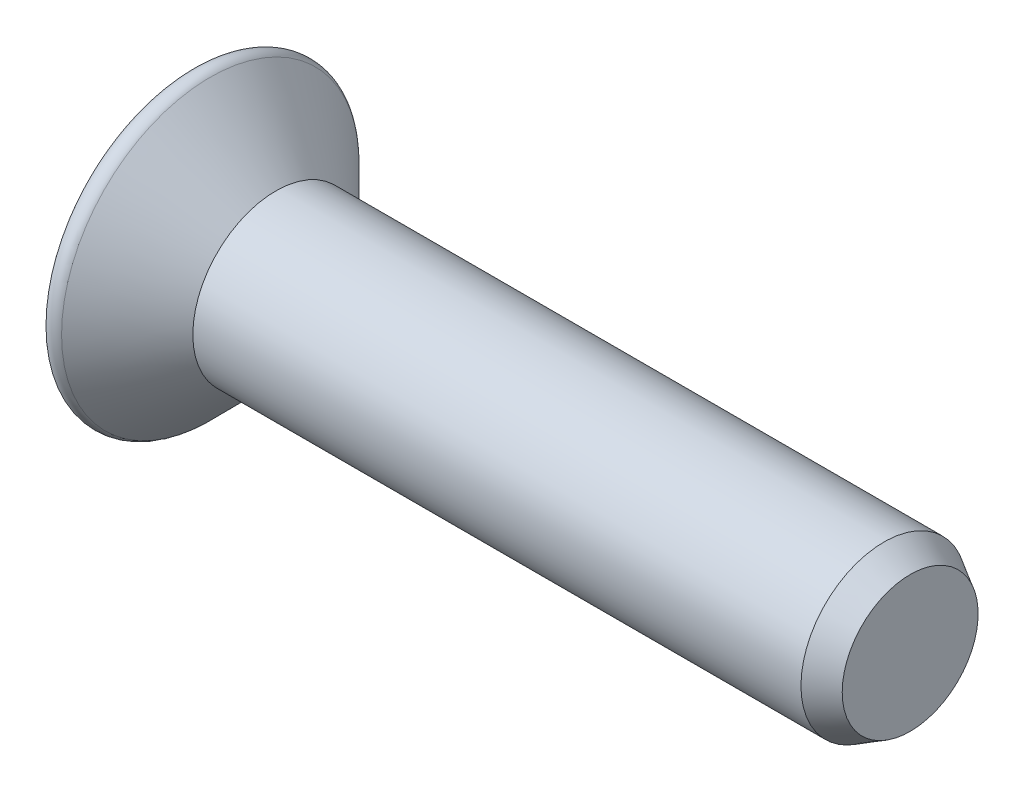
ISO-10303-21;
HEADER;
FILE_DESCRIPTION(('STEP AP214'),'2;1');
FILE_NAME('part.step','',(''),(''),'','','');
FILE_SCHEMA(('AUTOMOTIVE_DESIGN { 1 0 10303 214 1 1 1 1 }'));
ENDSEC;
DATA;
#1=APPLICATION_CONTEXT('core data for automotive mechanical design processes');
#2=APPLICATION_PROTOCOL_DEFINITION('international standard','automotive_design',2000,#1);
#3=PRODUCT_CONTEXT('',#1,'mechanical');
#4=PRODUCT('Part','Part','',(#3));
#5=PRODUCT_RELATED_PRODUCT_CATEGORY('part','',(#4));
#6=PRODUCT_DEFINITION_FORMATION('','',#4);
#7=PRODUCT_DEFINITION_CONTEXT('part definition',#1,'design');
#8=PRODUCT_DEFINITION('design','',#6,#7);
#9=PRODUCT_DEFINITION_SHAPE('','',#8);
#10=(LENGTH_UNIT() NAMED_UNIT(*) SI_UNIT(.MILLI.,.METRE.));
#11=(NAMED_UNIT(*) PLANE_ANGLE_UNIT() SI_UNIT($,.RADIAN.));
#12=(NAMED_UNIT(*) SI_UNIT($,.STERADIAN.) SOLID_ANGLE_UNIT());
#13=UNCERTAINTY_MEASURE_WITH_UNIT(LENGTH_MEASURE(1.E-05),#10,'distance_accuracy_value','');
#14=(GEOMETRIC_REPRESENTATION_CONTEXT(3) GLOBAL_UNCERTAINTY_ASSIGNED_CONTEXT((#13)) GLOBAL_UNIT_ASSIGNED_CONTEXT((#10,
#11,#12)) REPRESENTATION_CONTEXT('',''));
#15=CARTESIAN_POINT('',(0.,0.,0.));
#16=DIRECTION('',(0.,0.,1.));
#17=DIRECTION('',(1.,0.,0.));
#18=AXIS2_PLACEMENT_3D('',#15,#16,#17);
#19=CARTESIAN_POINT('',(2.4,0.,0.));
#20=DIRECTION('',(-1.,0.,0.));
#21=DIRECTION('',(0.,1.,0.));
#22=AXIS2_PLACEMENT_3D('',#19,#20,#21);
#23=SPHERICAL_SURFACE('',#22,4.);
#24=CARTESIAN_POINT('',(-1.1,0.,0.));
#25=DIRECTION('',(-1.,0.,0.));
#26=DIRECTION('',(0.,0.,1.));
#27=AXIS2_PLACEMENT_3D('',#24,#25,#26);
#28=CIRCLE('',#27,1.93649167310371);
#29=CARTESIAN_POINT('',(-1.1,0.,1.93649167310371));
#30=VERTEX_POINT('',#29);
#31=EDGE_CURVE('E193',#30,#30,#28,.T.);
#32=ORIENTED_EDGE('',*,*,#31,.T.);
#33=EDGE_LOOP('',(#32));
#34=FACE_BOUND('',#33,.T.);
#35=CARTESIAN_POINT('',(2.35629520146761,0.0815496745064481,0.407748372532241));
#36=DIRECTION('',(0.104528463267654,-0.195041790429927,-0.975208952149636));
#37=DIRECTION('',(0.,0.98058067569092,-0.196116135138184));
#38=AXIS2_PLACEMENT_3D('',#35,#36,#37);
#39=CIRCLE('',#38,3.97808758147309);
#40=CARTESIAN_POINT('',(-1.44518808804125,1.08372861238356,-0.200152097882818));
#41=VERTEX_POINT('',#40);
#42=CARTESIAN_POINT('',(-1.52998706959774,0.732056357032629,-0.138906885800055));
#43=VERTEX_POINT('',#42);
#44=EDGE_CURVE('E11',#41,#43,#39,.F.);
#45=ORIENTED_EDGE('',*,*,#44,.F.);
#46=CARTESIAN_POINT('',(2.47064663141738,0.672157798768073,0.));
#47=DIRECTION('',(0.104528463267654,0.994521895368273,0.));
#48=DIRECTION('',(-0.994521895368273,0.104528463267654,0.));
#49=AXIS2_PLACEMENT_3D('',#46,#47,#48);
#50=CIRCLE('',#49,3.94248816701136);
#51=CARTESIAN_POINT('',(-1.44518808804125,1.08372861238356,0.200152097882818));
#52=VERTEX_POINT('',#51);
#53=EDGE_CURVE('E49',#52,#41,#50,.F.);
#54=ORIENTED_EDGE('',*,*,#53,.F.);
#55=CARTESIAN_POINT('',(2.35629520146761,0.0815496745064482,-0.407748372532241));
#56=DIRECTION('',(0.104528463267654,-0.195041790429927,0.975208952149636));
#57=DIRECTION('',(0.,-0.98058067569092,-0.196116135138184));
#58=AXIS2_PLACEMENT_3D('',#55,#56,#57);
#59=CIRCLE('',#58,3.97808758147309);
#60=CARTESIAN_POINT('',(-1.52998706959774,0.732056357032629,0.138906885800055));
#61=VERTEX_POINT('',#60);
#62=EDGE_CURVE('E333',#61,#52,#59,.F.);
#63=ORIENTED_EDGE('',*,*,#62,.F.);
#64=CARTESIAN_POINT('',(2.40761651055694,0.0362331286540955,0.0627576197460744));
#65=DIRECTION('',(0.104528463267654,0.49726094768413,0.861281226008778));
#66=DIRECTION('',(0.,-0.866025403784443,0.499999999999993));
#67=AXIS2_PLACEMENT_3D('',#64,#65,#66);
#68=CIRCLE('',#67,3.99933627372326);
#69=CARTESIAN_POINT('',(-1.56766455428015,0.358913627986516,0.358913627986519));
#70=VERTEX_POINT('',#69);
#71=EDGE_CURVE('E331',#70,#61,#68,.F.);
#72=ORIENTED_EDGE('',*,*,#71,.F.);
#73=CARTESIAN_POINT('',(2.40761651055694,0.0627576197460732,0.0362331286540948));
#74=DIRECTION('',(0.104528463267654,0.861281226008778,0.497260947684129));
#75=DIRECTION('',(0.,-0.499999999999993,0.866025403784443));
#76=AXIS2_PLACEMENT_3D('',#73,#74,#75);
#77=CIRCLE('',#76,3.99933627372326);
#78=CARTESIAN_POINT('',(-1.52998706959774,0.138906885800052,0.732056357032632));
#79=VERTEX_POINT('',#78);
#80=EDGE_CURVE('E329',#79,#70,#77,.F.);
#81=ORIENTED_EDGE('',*,*,#80,.F.);
#82=CARTESIAN_POINT('',(2.35629520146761,-0.407748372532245,0.0815496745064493));
#83=DIRECTION('',(0.104528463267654,0.975208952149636,-0.195041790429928));
#84=DIRECTION('',(0.,0.196116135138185,0.98058067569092));
#85=AXIS2_PLACEMENT_3D('',#82,#83,#84);
#86=CIRCLE('',#85,3.97808758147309);
#87=CARTESIAN_POINT('',(-1.44518808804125,0.200152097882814,1.08372861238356));
#88=VERTEX_POINT('',#87);
#89=EDGE_CURVE('E327',#88,#79,#86,.F.);
#90=ORIENTED_EDGE('',*,*,#89,.F.);
#91=CARTESIAN_POINT('',(2.47064663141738,0.,0.672157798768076));
#92=DIRECTION('',(0.104528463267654,0.,0.994521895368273));
#93=DIRECTION('',(0.994521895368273,0.,-0.104528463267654));
#94=AXIS2_PLACEMENT_3D('',#91,#92,#93);
#95=CIRCLE('',#94,3.94248816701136);
#96=CARTESIAN_POINT('',(-1.44518808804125,-0.200152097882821,1.08372861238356));
#97=VERTEX_POINT('',#96);
#98=EDGE_CURVE('E325',#97,#88,#95,.F.);
#99=ORIENTED_EDGE('',*,*,#98,.F.);
#100=CARTESIAN_POINT('',(2.35629520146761,0.407748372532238,0.0815496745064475));
#101=DIRECTION('',(0.104528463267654,-0.975208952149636,-0.195041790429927));
#102=DIRECTION('',(0.,0.196116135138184,-0.98058067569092));
#103=AXIS2_PLACEMENT_3D('',#100,#101,#102);
#104=CIRCLE('',#103,3.97808758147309);
#105=CARTESIAN_POINT('',(-1.52998706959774,-0.138906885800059,0.732056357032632));
#106=VERTEX_POINT('',#105);
#107=EDGE_CURVE('E323',#106,#97,#104,.F.);
#108=ORIENTED_EDGE('',*,*,#107,.F.);
#109=CARTESIAN_POINT('',(2.40761651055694,-0.0627576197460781,0.0362331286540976));
#110=DIRECTION('',(0.104528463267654,-0.861281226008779,0.497260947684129));
#111=DIRECTION('',(0.,-0.499999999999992,-0.866025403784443));
#112=AXIS2_PLACEMENT_3D('',#109,#110,#111);
#113=CIRCLE('',#112,3.99933627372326);
#114=CARTESIAN_POINT('',(-1.56766455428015,-0.358913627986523,0.358913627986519));
#115=VERTEX_POINT('',#114);
#116=EDGE_CURVE('E321',#115,#106,#113,.F.);
#117=ORIENTED_EDGE('',*,*,#116,.F.);
#118=CARTESIAN_POINT('',(2.40761651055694,-0.0362331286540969,0.0627576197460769));
#119=DIRECTION('',(0.104528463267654,-0.497260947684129,0.861281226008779));
#120=DIRECTION('',(0.,-0.866025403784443,-0.499999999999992));
#121=AXIS2_PLACEMENT_3D('',#118,#119,#120);
#122=CIRCLE('',#121,3.99933627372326);
#123=CARTESIAN_POINT('',(-1.52998706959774,-0.732056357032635,0.138906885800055));
#124=VERTEX_POINT('',#123);
#125=EDGE_CURVE('E319',#124,#115,#122,.F.);
#126=ORIENTED_EDGE('',*,*,#125,.F.);
#127=CARTESIAN_POINT('',(2.35629520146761,-0.0815496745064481,-0.407748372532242));
#128=DIRECTION('',(0.104528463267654,0.195041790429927,0.975208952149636));
#129=DIRECTION('',(0.,-0.98058067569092,0.196116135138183));
#130=AXIS2_PLACEMENT_3D('',#127,#128,#129);
#131=CIRCLE('',#130,3.97808758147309);
#132=CARTESIAN_POINT('',(-1.44518808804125,-1.08372861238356,0.200152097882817));
#133=VERTEX_POINT('',#132);
#134=EDGE_CURVE('E317',#133,#124,#131,.F.);
#135=ORIENTED_EDGE('',*,*,#134,.F.);
#136=CARTESIAN_POINT('',(2.47064663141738,-0.672157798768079,0.));
#137=DIRECTION('',(0.104528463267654,-0.994521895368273,0.));
#138=DIRECTION('',(0.994521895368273,0.104528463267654,0.));
#139=AXIS2_PLACEMENT_3D('',#136,#137,#138);
#140=CIRCLE('',#139,3.94248816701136);
#141=CARTESIAN_POINT('',(-1.44518808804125,-1.08372861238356,-0.200152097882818));
#142=VERTEX_POINT('',#141);
#143=EDGE_CURVE('E315',#142,#133,#140,.F.);
#144=ORIENTED_EDGE('',*,*,#143,.F.);
#145=CARTESIAN_POINT('',(2.35629520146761,-0.0815496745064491,0.407748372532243));
#146=DIRECTION('',(0.104528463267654,0.195041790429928,-0.975208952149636));
#147=DIRECTION('',(0.,0.98058067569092,0.196116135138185));
#148=AXIS2_PLACEMENT_3D('',#145,#146,#147);
#149=CIRCLE('',#148,3.97808758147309);
#150=CARTESIAN_POINT('',(-1.52998706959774,-0.732056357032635,-0.138906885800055));
#151=VERTEX_POINT('',#150);
#152=EDGE_CURVE('E313',#151,#142,#149,.F.);
#153=ORIENTED_EDGE('',*,*,#152,.F.);
#154=CARTESIAN_POINT('',(2.40761651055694,-0.0362331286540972,-0.0627576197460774));
#155=DIRECTION('',(0.104528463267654,-0.497260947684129,-0.861281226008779));
#156=DIRECTION('',(0.,0.866025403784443,-0.499999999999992));
#157=AXIS2_PLACEMENT_3D('',#154,#155,#156);
#158=CIRCLE('',#157,3.99933627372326);
#159=CARTESIAN_POINT('',(-1.56766455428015,-0.358913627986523,-0.358913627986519));
#160=VERTEX_POINT('',#159);
#161=EDGE_CURVE('E311',#160,#151,#158,.F.);
#162=ORIENTED_EDGE('',*,*,#161,.F.);
#163=CARTESIAN_POINT('',(2.40761651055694,-0.0627576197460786,-0.036233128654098));
#164=DIRECTION('',(0.104528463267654,-0.861281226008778,-0.497260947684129));
#165=DIRECTION('',(0.,0.499999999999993,-0.866025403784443));
#166=AXIS2_PLACEMENT_3D('',#163,#164,#165);
#167=CIRCLE('',#166,3.99933627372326);
#168=CARTESIAN_POINT('',(-1.52998706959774,-0.138906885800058,-0.732056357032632));
#169=VERTEX_POINT('',#168);
#170=EDGE_CURVE('E309',#169,#160,#167,.F.);
#171=ORIENTED_EDGE('',*,*,#170,.F.);
#172=CARTESIAN_POINT('',(2.35629520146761,0.407748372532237,-0.0815496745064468));
#173=DIRECTION('',(0.104528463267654,-0.975208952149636,0.195041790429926));
#174=DIRECTION('',(0.,-0.196116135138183,-0.980580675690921));
#175=AXIS2_PLACEMENT_3D('',#172,#173,#174);
#176=CIRCLE('',#175,3.97808758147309);
#177=CARTESIAN_POINT('',(-1.44518808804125,-0.200152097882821,-1.08372861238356));
#178=VERTEX_POINT('',#177);
#179=EDGE_CURVE('E307',#178,#169,#176,.F.);
#180=ORIENTED_EDGE('',*,*,#179,.F.);
#181=CARTESIAN_POINT('',(2.47064663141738,0.,-0.672157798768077));
#182=DIRECTION('',(0.104528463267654,0.,-0.994521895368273));
#183=DIRECTION('',(-0.994521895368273,0.,-0.104528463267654));
#184=AXIS2_PLACEMENT_3D('',#181,#182,#183);
#185=CIRCLE('',#184,3.94248816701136);
#186=CARTESIAN_POINT('',(-1.44518808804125,0.200152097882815,-1.08372861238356));
#187=VERTEX_POINT('',#186);
#188=EDGE_CURVE('E305',#187,#178,#185,.F.);
#189=ORIENTED_EDGE('',*,*,#188,.F.);
#190=CARTESIAN_POINT('',(2.35629520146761,-0.407748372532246,-0.0815496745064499));
#191=DIRECTION('',(0.104528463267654,0.975208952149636,0.195041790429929));
#192=DIRECTION('',(0.,-0.196116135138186,0.98058067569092));
#193=AXIS2_PLACEMENT_3D('',#190,#191,#192);
#194=CIRCLE('',#193,3.97808758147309);
#195=CARTESIAN_POINT('',(-1.52998706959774,0.138906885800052,-0.732056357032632));
#196=VERTEX_POINT('',#195);
#197=EDGE_CURVE('E303',#196,#187,#194,.F.);
#198=ORIENTED_EDGE('',*,*,#197,.F.);
#199=CARTESIAN_POINT('',(2.40761651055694,0.0627576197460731,-0.0362331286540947));
#200=DIRECTION('',(0.104528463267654,0.861281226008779,-0.497260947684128));
#201=DIRECTION('',(0.,0.499999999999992,0.866025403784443));
#202=AXIS2_PLACEMENT_3D('',#199,#200,#201);
#203=CIRCLE('',#202,3.99933627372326);
#204=CARTESIAN_POINT('',(-1.56766455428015,0.358913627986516,-0.358913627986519));
#205=VERTEX_POINT('',#204);
#206=EDGE_CURVE('E301',#205,#196,#203,.F.);
#207=ORIENTED_EDGE('',*,*,#206,.F.);
#208=CARTESIAN_POINT('',(2.40761651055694,0.0362331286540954,-0.0627576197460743));
#209=DIRECTION('',(0.104528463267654,0.497260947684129,-0.861281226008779));
#210=DIRECTION('',(0.,0.866025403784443,0.499999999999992));
#211=AXIS2_PLACEMENT_3D('',#208,#209,#210);
#212=CIRCLE('',#211,3.99933627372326);
#213=EDGE_CURVE('E299',#43,#205,#212,.F.);
#214=ORIENTED_EDGE('',*,*,#213,.F.);
#215=EDGE_LOOP('',(#45,#54,#63,#72,#81,#90,#99,#108,#117,#126,#135,#144,#153,#162,#171,#180,
#189,#198,#207,#214));
#216=FACE_BOUND('',#215,.T.);
#217=ADVANCED_FACE('F41',(#34,#216),#23,.T.);
#218=CARTESIAN_POINT('',(-0.972266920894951,0.,0.));
#219=DIRECTION('',(-1.,0.,0.));
#220=DIRECTION('',(0.,0.,1.));
#221=AXIS2_PLACEMENT_3D('',#218,#219,#220);
#222=TOROIDAL_SURFACE('',#221,1.86581908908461,0.145980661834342);
#223=ORIENTED_EDGE('',*,*,#31,.F.);
#224=EDGE_LOOP('',(#223));
#225=FACE_BOUND('',#224,.T.);
#226=CARTESIAN_POINT('',(-0.869043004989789,0.,0.));
#227=DIRECTION('',(-1.,0.,0.));
#228=DIRECTION('',(0.,0.,1.));
#229=AXIS2_PLACEMENT_3D('',#226,#227,#228);
#230=CIRCLE('',#229,1.96904300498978);
#231=CARTESIAN_POINT('',(-0.869043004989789,0.,1.96904300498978));
#232=VERTEX_POINT('',#231);
#233=EDGE_CURVE('E290',#232,#232,#230,.T.);
#234=ORIENTED_EDGE('',*,*,#233,.T.);
#235=EDGE_LOOP('',(#234));
#236=FACE_BOUND('',#235,.T.);
#237=ADVANCED_FACE('F429',(#225,#236),#222,.T.);
#238=CARTESIAN_POINT('',(0.,0.,0.));
#239=DIRECTION('',(-1.,0.,0.));
#240=DIRECTION('',(0.,0.,1.));
#241=AXIS2_PLACEMENT_3D('',#238,#239,#240);
#242=CONICAL_SURFACE('',#241,1.1,0.785398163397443);
#243=ORIENTED_EDGE('',*,*,#233,.F.);
#244=EDGE_LOOP('',(#243));
#245=FACE_BOUND('',#244,.T.);
#246=CARTESIAN_POINT('',(0.,0.,0.));
#247=DIRECTION('',(-1.,0.,0.));
#248=DIRECTION('',(0.,0.,1.));
#249=AXIS2_PLACEMENT_3D('',#246,#247,#248);
#250=CIRCLE('',#249,1.1);
#251=CARTESIAN_POINT('',(0.,0.,1.1));
#252=VERTEX_POINT('',#251);
#253=EDGE_CURVE('E197',#252,#252,#250,.T.);
#254=ORIENTED_EDGE('',*,*,#253,.T.);
#255=EDGE_LOOP('',(#254));
#256=FACE_BOUND('',#255,.T.);
#257=ADVANCED_FACE('F437',(#245,#256),#242,.T.);
#258=CARTESIAN_POINT('',(0.,0.,0.));
#259=DIRECTION('',(-1.,0.,0.));
#260=DIRECTION('',(0.,0.,1.));
#261=AXIS2_PLACEMENT_3D('',#258,#259,#260);
#262=CYLINDRICAL_SURFACE('',#261,1.1);
#263=CARTESIAN_POINT('',(8.05358983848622,0.,0.));
#264=DIRECTION('',(-1.,0.,0.));
#265=DIRECTION('',(0.,0.,1.));
#266=AXIS2_PLACEMENT_3D('',#263,#264,#265);
#267=CIRCLE('',#266,1.1);
#268=CARTESIAN_POINT('',(8.05358983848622,0.,1.1));
#269=VERTEX_POINT('',#268);
#270=EDGE_CURVE('E293',#269,#269,#267,.T.);
#271=ORIENTED_EDGE('',*,*,#270,.T.);
#272=EDGE_LOOP('',(#271));
#273=FACE_BOUND('',#272,.T.);
#274=ORIENTED_EDGE('',*,*,#253,.F.);
#275=EDGE_LOOP('',(#274));
#276=FACE_BOUND('',#275,.T.);
#277=ADVANCED_FACE('F444',(#273,#276),#262,.T.);
#278=CARTESIAN_POINT('',(8.4,1.1,0.));
#279=DIRECTION('',(-1.,0.,0.));
#280=DIRECTION('',(0.,0.,1.));
#281=AXIS2_PLACEMENT_3D('',#278,#279,#280);
#282=PLANE('',#281);
#283=CARTESIAN_POINT('',(8.4,0.,0.));
#284=DIRECTION('',(-1.,0.,0.));
#285=DIRECTION('',(0.,0.,1.));
#286=AXIS2_PLACEMENT_3D('',#283,#284,#285);
#287=CIRCLE('',#286,0.899999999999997);
#288=CARTESIAN_POINT('',(8.4,0.,0.899999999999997));
#289=VERTEX_POINT('',#288);
#290=EDGE_CURVE('E296',#289,#289,#287,.F.);
#291=ORIENTED_EDGE('',*,*,#290,.T.);
#292=EDGE_LOOP('',(#291));
#293=FACE_BOUND('',#292,.T.);
#294=ADVANCED_FACE('F441',(#293),#282,.F.);
#295=CARTESIAN_POINT('',(8.05358983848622,0.,0.));
#296=DIRECTION('',(-1.,0.,0.));
#297=DIRECTION('',(0.,0.,1.));
#298=AXIS2_PLACEMENT_3D('',#295,#296,#297);
#299=CONICAL_SURFACE('',#298,1.1,0.523598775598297);
#300=ORIENTED_EDGE('',*,*,#290,.F.);
#301=EDGE_LOOP('',(#300));
#302=FACE_BOUND('',#301,.T.);
#303=ORIENTED_EDGE('',*,*,#270,.F.);
#304=EDGE_LOOP('',(#303));
#305=FACE_BOUND('',#304,.T.);
#306=ADVANCED_FACE('F43',(#302,#305),#299,.T.);
#307=CARTESIAN_POINT('',(-1.6,1.1,-0.22));
#308=DIRECTION('',(0.104528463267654,-0.195041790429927,-0.975208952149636));
#309=DIRECTION('',(0.,0.98058067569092,-0.196116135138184));
#310=AXIS2_PLACEMENT_3D('',#307,#308,#309);
#311=PLANE('',#310);
#312=ORIENTED_EDGE('',*,*,#44,.T.);
#313=DIRECTION('',(-0.993750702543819,0.0181251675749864,-0.110140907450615));
#314=VECTOR('',#313,1.);
#315=CARTESIAN_POINT('',(-1.6,0.733333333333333,-0.146666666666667));
#316=LINE('',#315,#314);
#317=CARTESIAN_POINT('',(-0.8,0.718742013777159,-0.0579998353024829));
#318=VERTEX_POINT('',#317);
#319=EDGE_CURVE('E56',#318,#43,#316,.T.);
#320=ORIENTED_EDGE('',*,*,#319,.F.);
#321=DIRECTION('',(0.,-0.98058067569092,0.196116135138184));
#322=VECTOR('',#321,1.);
#323=CARTESIAN_POINT('',(-0.8,0.0164901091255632,0.0824505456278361));
#324=LINE('',#323,#322);
#325=CARTESIAN_POINT('',(-0.8,1.01591661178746,-0.117434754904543));
#326=VERTEX_POINT('',#325);
#327=EDGE_CURVE('E182',#318,#326,#324,.F.);
#328=ORIENTED_EDGE('',*,*,#327,.T.);
#329=DIRECTION('',(-0.986535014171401,0.103689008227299,-0.126480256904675));
#330=VECTOR('',#329,1.);
#331=CARTESIAN_POINT('',(-1.54509803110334,1.09422957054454,-0.212961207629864));
#332=LINE('',#331,#330);
#333=EDGE_CURVE('E189',#326,#41,#332,.T.);
#334=ORIENTED_EDGE('',*,*,#333,.T.);
#335=EDGE_LOOP('',(#312,#320,#328,#334));
#336=FACE_BOUND('',#335,.T.);
#337=ADVANCED_FACE('F188',(#336),#311,.F.);
#338=CARTESIAN_POINT('',(-1.6,1.1,0.22));
#339=DIRECTION('',(0.104528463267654,0.994521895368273,0.));
#340=DIRECTION('',(-0.994521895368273,0.104528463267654,0.));
#341=AXIS2_PLACEMENT_3D('',#338,#339,#340);
#342=PLANE('',#341);
#343=ORIENTED_EDGE('',*,*,#53,.T.);
#344=ORIENTED_EDGE('',*,*,#333,.F.);
#345=DIRECTION('',(0.,0.,-1.));
#346=VECTOR('',#345,1.);
#347=CARTESIAN_POINT('',(-0.8,1.01591661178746,0.));
#348=LINE('',#347,#346);
#349=CARTESIAN_POINT('',(-0.8,1.01591661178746,0.117434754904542));
#350=VERTEX_POINT('',#349);
#351=EDGE_CURVE('E178',#326,#350,#348,.F.);
#352=ORIENTED_EDGE('',*,*,#351,.T.);
#353=DIRECTION('',(-0.986535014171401,0.103689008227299,0.126480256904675));
#354=VECTOR('',#353,1.);
#355=CARTESIAN_POINT('',(-1.6,1.1,0.22));
#356=LINE('',#355,#354);
#357=EDGE_CURVE('E194',#350,#52,#356,.T.);
#358=ORIENTED_EDGE('',*,*,#357,.T.);
#359=EDGE_LOOP('',(#343,#344,#352,#358));
#360=FACE_BOUND('',#359,.T.);
#361=ADVANCED_FACE('F192',(#360),#342,.F.);
#362=CARTESIAN_POINT('',(-1.6,1.1,0.22));
#363=DIRECTION('',(0.104528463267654,-0.195041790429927,0.975208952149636));
#364=DIRECTION('',(0.,-0.98058067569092,-0.196116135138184));
#365=AXIS2_PLACEMENT_3D('',#362,#363,#364);
#366=PLANE('',#365);
#367=ORIENTED_EDGE('',*,*,#62,.T.);
#368=ORIENTED_EDGE('',*,*,#357,.F.);
#369=DIRECTION('',(0.,0.98058067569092,0.196116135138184));
#370=VECTOR('',#369,1.);
#371=CARTESIAN_POINT('',(-0.8,0.0164901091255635,-0.0824505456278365));
#372=LINE('',#371,#370);
#373=CARTESIAN_POINT('',(-0.8,0.718742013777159,0.0579998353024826));
#374=VERTEX_POINT('',#373);
#375=EDGE_CURVE('E184',#350,#374,#372,.F.);
#376=ORIENTED_EDGE('',*,*,#375,.T.);
#377=DIRECTION('',(-0.993750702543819,0.0181251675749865,0.110140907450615));
#378=VECTOR('',#377,1.);
#379=CARTESIAN_POINT('',(-1.61463088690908,0.733600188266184,0.148288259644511));
#380=LINE('',#379,#378);
#381=EDGE_CURVE('E199',#374,#61,#380,.T.);
#382=ORIENTED_EDGE('',*,*,#381,.T.);
#383=EDGE_LOOP('',(#367,#368,#376,#382));
#384=FACE_BOUND('',#383,.T.);
#385=ADVANCED_FACE('F336',(#384),#366,.F.);
#386=CARTESIAN_POINT('',(-1.6,0.733333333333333,0.146666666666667));
#387=DIRECTION('',(0.104528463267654,0.49726094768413,0.861281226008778));
#388=DIRECTION('',(0.,-0.866025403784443,0.499999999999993));
#389=AXIS2_PLACEMENT_3D('',#386,#387,#388);
#390=PLANE('',#389);
#391=ORIENTED_EDGE('',*,*,#71,.T.);
#392=ORIENTED_EDGE('',*,*,#381,.F.);
#393=DIRECTION('',(0.,0.866025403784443,-0.499999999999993));
#394=VECTOR('',#393,1.);
#395=CARTESIAN_POINT('',(-0.8,0.204800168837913,0.354724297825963));
#396=LINE('',#395,#394);
#397=CARTESIAN_POINT('',(-0.8,0.29984825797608,0.299848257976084));
#398=VERTEX_POINT('',#397);
#399=EDGE_CURVE('E255',#374,#398,#396,.F.);
#400=ORIENTED_EDGE('',*,*,#399,.T.);
#401=DIRECTION('',(-0.994132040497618,0.0764901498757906,0.0764901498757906));
#402=VECTOR('',#401,1.);
#403=CARTESIAN_POINT('',(-1.61195345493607,0.362321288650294,0.362321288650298));
#404=LINE('',#403,#402);
#405=EDGE_CURVE('E249',#398,#70,#404,.T.);
#406=ORIENTED_EDGE('',*,*,#405,.T.);
#407=EDGE_LOOP('',(#391,#392,#400,#406));
#408=FACE_BOUND('',#407,.T.);
#409=ADVANCED_FACE('F419',(#408),#390,.F.);
#410=CARTESIAN_POINT('',(-1.6,0.146666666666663,0.733333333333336));
#411=DIRECTION('',(0.104528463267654,0.861281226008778,0.497260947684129));
#412=DIRECTION('',(0.,-0.499999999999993,0.866025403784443));
#413=AXIS2_PLACEMENT_3D('',#410,#411,#412);
#414=PLANE('',#413);
#415=ORIENTED_EDGE('',*,*,#80,.T.);
#416=ORIENTED_EDGE('',*,*,#405,.F.);
#417=DIRECTION('',(0.,0.499999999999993,-0.866025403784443));
#418=VECTOR('',#417,1.);
#419=CARTESIAN_POINT('',(-0.8,0.354724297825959,0.204800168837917));
#420=LINE('',#419,#418);
#421=CARTESIAN_POINT('',(-0.8,0.0579998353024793,0.718742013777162));
#422=VERTEX_POINT('',#421);
#423=EDGE_CURVE('E257',#398,#422,#420,.F.);
#424=ORIENTED_EDGE('',*,*,#423,.T.);
#425=DIRECTION('',(-0.993750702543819,0.110140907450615,0.0181251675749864));
#426=VECTOR('',#425,1.);
#427=CARTESIAN_POINT('',(-1.6,0.146666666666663,0.733333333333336));
#428=LINE('',#427,#426);
#429=EDGE_CURVE('E246',#422,#79,#428,.T.);
#430=ORIENTED_EDGE('',*,*,#429,.T.);
#431=EDGE_LOOP('',(#415,#416,#424,#430));
#432=FACE_BOUND('',#431,.T.);
#433=ADVANCED_FACE('F416',(#432),#414,.F.);
#434=CARTESIAN_POINT('',(-1.6,0.219999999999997,1.1));
#435=DIRECTION('',(0.104528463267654,0.975208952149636,-0.195041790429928));
#436=DIRECTION('',(0.,0.196116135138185,0.98058067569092));
#437=AXIS2_PLACEMENT_3D('',#434,#435,#436);
#438=PLANE('',#437);
#439=ORIENTED_EDGE('',*,*,#89,.T.);
#440=ORIENTED_EDGE('',*,*,#429,.F.);
#441=DIRECTION('',(0.,-0.196116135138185,-0.98058067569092));
#442=VECTOR('',#441,1.);
#443=CARTESIAN_POINT('',(-0.8,-0.0824505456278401,0.0164901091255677));
#444=LINE('',#443,#442);
#445=CARTESIAN_POINT('',(-0.8,0.117434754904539,1.01591661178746));
#446=VERTEX_POINT('',#445);
#447=EDGE_CURVE('E259',#422,#446,#444,.F.);
#448=ORIENTED_EDGE('',*,*,#447,.T.);
#449=DIRECTION('',(-0.986535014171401,0.126480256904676,0.103689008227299));
#450=VECTOR('',#449,1.);
#451=CARTESIAN_POINT('',(-1.54509803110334,0.212961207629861,1.09422957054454));
#452=LINE('',#451,#450);
#453=EDGE_CURVE('E243',#446,#88,#452,.T.);
#454=ORIENTED_EDGE('',*,*,#453,.T.);
#455=EDGE_LOOP('',(#439,#440,#448,#454));
#456=FACE_BOUND('',#455,.T.);
#457=ADVANCED_FACE('F413',(#456),#438,.F.);
#458=CARTESIAN_POINT('',(-1.6,-0.220000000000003,1.1));
#459=DIRECTION('',(0.104528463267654,0.,0.994521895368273));
#460=DIRECTION('',(0.994521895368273,0.,-0.104528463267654));
#461=AXIS2_PLACEMENT_3D('',#458,#459,#460);
#462=PLANE('',#461);
#463=ORIENTED_EDGE('',*,*,#98,.T.);
#464=ORIENTED_EDGE('',*,*,#453,.F.);
#465=DIRECTION('',(0.,1.,0.));
#466=VECTOR('',#465,1.);
#467=CARTESIAN_POINT('',(-0.8,0.,1.01591661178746));
#468=LINE('',#467,#466);
#469=CARTESIAN_POINT('',(-0.8,-0.117434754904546,1.01591661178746));
#470=VERTEX_POINT('',#469);
#471=EDGE_CURVE('E261',#446,#470,#468,.F.);
#472=ORIENTED_EDGE('',*,*,#471,.T.);
#473=DIRECTION('',(-0.986535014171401,-0.126480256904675,0.103689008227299));
#474=VECTOR('',#473,1.);
#475=CARTESIAN_POINT('',(-1.6,-0.220000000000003,1.1));
#476=LINE('',#475,#474);
#477=EDGE_CURVE('E240',#470,#97,#476,.T.);
#478=ORIENTED_EDGE('',*,*,#477,.T.);
#479=EDGE_LOOP('',(#463,#464,#472,#478));
#480=FACE_BOUND('',#479,.T.);
#481=ADVANCED_FACE('F406',(#480),#462,.F.);
#482=CARTESIAN_POINT('',(-1.6,-0.220000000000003,1.1));
#483=DIRECTION('',(0.104528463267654,-0.975208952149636,-0.195041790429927));
#484=DIRECTION('',(0.,0.196116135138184,-0.98058067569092));
#485=AXIS2_PLACEMENT_3D('',#482,#483,#484);
#486=PLANE('',#485);
#487=ORIENTED_EDGE('',*,*,#107,.T.);
#488=ORIENTED_EDGE('',*,*,#477,.F.);
#489=DIRECTION('',(0.,-0.196116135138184,0.98058067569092));
#490=VECTOR('',#489,1.);
#491=CARTESIAN_POINT('',(-0.8,0.0824505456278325,0.0164901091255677));
#492=LINE('',#491,#490);
#493=CARTESIAN_POINT('',(-0.8,-0.0579998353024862,0.718742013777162));
#494=VERTEX_POINT('',#493);
#495=EDGE_CURVE('E263',#470,#494,#492,.F.);
#496=ORIENTED_EDGE('',*,*,#495,.T.);
#497=DIRECTION('',(-0.993750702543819,-0.110140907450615,0.0181251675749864));
#498=VECTOR('',#497,1.);
#499=CARTESIAN_POINT('',(-1.61463088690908,-0.148288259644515,0.733600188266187));
#500=LINE('',#499,#498);
#501=EDGE_CURVE('E237',#494,#106,#500,.T.);
#502=ORIENTED_EDGE('',*,*,#501,.T.);
#503=EDGE_LOOP('',(#487,#488,#496,#502));
#504=FACE_BOUND('',#503,.T.);
#505=ADVANCED_FACE('F404',(#504),#486,.F.);
#506=CARTESIAN_POINT('',(-1.6,-0.14666666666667,0.733333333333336));
#507=DIRECTION('',(0.104528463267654,-0.861281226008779,0.497260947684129));
#508=DIRECTION('',(0.,-0.499999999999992,-0.866025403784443));
#509=AXIS2_PLACEMENT_3D('',#506,#507,#508);
#510=PLANE('',#509);
#511=ORIENTED_EDGE('',*,*,#116,.T.);
#512=ORIENTED_EDGE('',*,*,#501,.F.);
#513=DIRECTION('',(0.,0.499999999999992,0.866025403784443));
#514=VECTOR('',#513,1.);
#515=CARTESIAN_POINT('',(-0.8,-0.354724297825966,0.204800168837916));
#516=LINE('',#515,#514);
#517=CARTESIAN_POINT('',(-0.8,-0.299848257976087,0.299848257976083));
#518=VERTEX_POINT('',#517);
#519=EDGE_CURVE('E265',#494,#518,#516,.F.);
#520=ORIENTED_EDGE('',*,*,#519,.T.);
#521=DIRECTION('',(-0.994132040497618,-0.0764901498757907,0.0764901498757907));
#522=VECTOR('',#521,1.);
#523=CARTESIAN_POINT('',(-1.61195345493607,-0.362321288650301,0.362321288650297));
#524=LINE('',#523,#522);
#525=EDGE_CURVE('E234',#518,#115,#524,.T.);
#526=ORIENTED_EDGE('',*,*,#525,.T.);
#527=EDGE_LOOP('',(#511,#512,#520,#526));
#528=FACE_BOUND('',#527,.T.);
#529=ADVANCED_FACE('F397',(#528),#510,.F.);
#530=CARTESIAN_POINT('',(-1.6,-0.73333333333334,0.146666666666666));
#531=DIRECTION('',(0.104528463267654,-0.497260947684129,0.861281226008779));
#532=DIRECTION('',(0.,-0.866025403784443,-0.499999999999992));
#533=AXIS2_PLACEMENT_3D('',#530,#531,#532);
#534=PLANE('',#533);
#535=ORIENTED_EDGE('',*,*,#125,.T.);
#536=ORIENTED_EDGE('',*,*,#525,.F.);
#537=DIRECTION('',(0.,0.866025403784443,0.499999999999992));
#538=VECTOR('',#537,1.);
#539=CARTESIAN_POINT('',(-0.8,-0.20480016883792,0.354724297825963));
#540=LINE('',#539,#538);
#541=CARTESIAN_POINT('',(-0.8,-0.718742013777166,0.0579998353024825));
#542=VERTEX_POINT('',#541);
#543=EDGE_CURVE('E267',#518,#542,#540,.F.);
#544=ORIENTED_EDGE('',*,*,#543,.T.);
#545=DIRECTION('',(-0.993750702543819,-0.0181251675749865,0.110140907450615));
#546=VECTOR('',#545,1.);
#547=CARTESIAN_POINT('',(-1.6,-0.73333333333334,0.146666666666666));
#548=LINE('',#547,#546);
#549=EDGE_CURVE('E231',#542,#124,#548,.T.);
#550=ORIENTED_EDGE('',*,*,#549,.T.);
#551=EDGE_LOOP('',(#535,#536,#544,#550));
#552=FACE_BOUND('',#551,.T.);
#553=ADVANCED_FACE('F394',(#552),#534,.F.);
#554=CARTESIAN_POINT('',(-1.6,-1.10000000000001,0.219999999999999));
#555=DIRECTION('',(0.104528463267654,0.195041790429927,0.975208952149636));
#556=DIRECTION('',(0.,-0.98058067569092,0.196116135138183));
#557=AXIS2_PLACEMENT_3D('',#554,#555,#556);
#558=PLANE('',#557);
#559=ORIENTED_EDGE('',*,*,#134,.T.);
#560=ORIENTED_EDGE('',*,*,#549,.F.);
#561=DIRECTION('',(0.,0.98058067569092,-0.196116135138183));
#562=VECTOR('',#561,1.);
#563=CARTESIAN_POINT('',(-0.8,-0.0164901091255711,-0.082450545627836));
#564=LINE('',#563,#562);
#565=CARTESIAN_POINT('',(-0.8,-1.01591661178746,0.117434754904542));
#566=VERTEX_POINT('',#565);
#567=EDGE_CURVE('E269',#542,#566,#564,.F.);
#568=ORIENTED_EDGE('',*,*,#567,.T.);
#569=DIRECTION('',(-0.986535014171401,-0.103689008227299,0.126480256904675));
#570=VECTOR('',#569,1.);
#571=CARTESIAN_POINT('',(-1.54509803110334,-1.09422957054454,0.212961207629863));
#572=LINE('',#571,#570);
#573=EDGE_CURVE('E228',#566,#133,#572,.T.);
#574=ORIENTED_EDGE('',*,*,#573,.T.);
#575=EDGE_LOOP('',(#559,#560,#568,#574));
#576=FACE_BOUND('',#575,.T.);
#577=ADVANCED_FACE('F386',(#576),#558,.F.);
#578=CARTESIAN_POINT('',(-1.6,-1.10000000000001,-0.220000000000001));
#579=DIRECTION('',(0.104528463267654,-0.994521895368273,0.));
#580=DIRECTION('',(0.994521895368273,0.104528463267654,0.));
#581=AXIS2_PLACEMENT_3D('',#578,#579,#580);
#582=PLANE('',#581);
#583=ORIENTED_EDGE('',*,*,#143,.T.);
#584=ORIENTED_EDGE('',*,*,#573,.F.);
#585=DIRECTION('',(0.,0.,1.));
#586=VECTOR('',#585,1.);
#587=CARTESIAN_POINT('',(-0.8,-1.01591661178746,0.));
#588=LINE('',#587,#586);
#589=CARTESIAN_POINT('',(-0.8,-1.01591661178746,-0.117434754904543));
#590=VERTEX_POINT('',#589);
#591=EDGE_CURVE('E271',#566,#590,#588,.F.);
#592=ORIENTED_EDGE('',*,*,#591,.T.);
#593=DIRECTION('',(-0.986535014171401,-0.103689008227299,-0.126480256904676));
#594=VECTOR('',#593,1.);
#595=CARTESIAN_POINT('',(-1.6,-1.10000000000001,-0.220000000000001));
#596=LINE('',#595,#594);
#597=EDGE_CURVE('E225',#590,#142,#596,.T.);
#598=ORIENTED_EDGE('',*,*,#597,.T.);
#599=EDGE_LOOP('',(#583,#584,#592,#598));
#600=FACE_BOUND('',#599,.T.);
#601=ADVANCED_FACE('F384',(#600),#582,.F.);
#602=CARTESIAN_POINT('',(-1.6,-1.10000000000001,-0.220000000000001));
#603=DIRECTION('',(0.104528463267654,0.195041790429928,-0.975208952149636));
#604=DIRECTION('',(0.,0.98058067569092,0.196116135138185));
#605=AXIS2_PLACEMENT_3D('',#602,#603,#604);
#606=PLANE('',#605);
#607=ORIENTED_EDGE('',*,*,#152,.T.);
#608=ORIENTED_EDGE('',*,*,#597,.F.);
#609=DIRECTION('',(0.,-0.98058067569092,-0.196116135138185));
#610=VECTOR('',#609,1.);
#611=CARTESIAN_POINT('',(-0.8,-0.0164901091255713,0.0824505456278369));
#612=LINE('',#611,#610);
#613=CARTESIAN_POINT('',(-0.8,-0.718742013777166,-0.057999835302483));
#614=VERTEX_POINT('',#613);
#615=EDGE_CURVE('E273',#590,#614,#612,.F.);
#616=ORIENTED_EDGE('',*,*,#615,.T.);
#617=DIRECTION('',(-0.993750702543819,-0.0181251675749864,-0.110140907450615));
#618=VECTOR('',#617,1.);
#619=CARTESIAN_POINT('',(-1.61463088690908,-0.733600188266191,-0.148288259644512));
#620=LINE('',#619,#618);
#621=EDGE_CURVE('E222',#614,#151,#620,.T.);
#622=ORIENTED_EDGE('',*,*,#621,.T.);
#623=EDGE_LOOP('',(#607,#608,#616,#622));
#624=FACE_BOUND('',#623,.T.);
#625=ADVANCED_FACE('F377',(#624),#606,.F.);
#626=CARTESIAN_POINT('',(-1.6,-0.73333333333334,-0.146666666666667));
#627=DIRECTION('',(0.104528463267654,-0.497260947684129,-0.861281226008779));
#628=DIRECTION('',(0.,0.866025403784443,-0.499999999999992));
#629=AXIS2_PLACEMENT_3D('',#626,#627,#628);
#630=PLANE('',#629);
#631=ORIENTED_EDGE('',*,*,#161,.T.);
#632=ORIENTED_EDGE('',*,*,#621,.F.);
#633=DIRECTION('',(0.,-0.866025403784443,0.499999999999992));
#634=VECTOR('',#633,1.);
#635=CARTESIAN_POINT('',(-0.8,-0.204800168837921,-0.354724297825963));
#636=LINE('',#635,#634);
#637=CARTESIAN_POINT('',(-0.8,-0.299848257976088,-0.299848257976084));
#638=VERTEX_POINT('',#637);
#639=EDGE_CURVE('E275',#614,#638,#636,.F.);
#640=ORIENTED_EDGE('',*,*,#639,.T.);
#641=DIRECTION('',(-0.994132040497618,-0.0764901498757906,-0.0764901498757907));
#642=VECTOR('',#641,1.);
#643=CARTESIAN_POINT('',(-1.61195345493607,-0.362321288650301,-0.362321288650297));
#644=LINE('',#643,#642);
#645=EDGE_CURVE('E219',#638,#160,#644,.T.);
#646=ORIENTED_EDGE('',*,*,#645,.T.);
#647=EDGE_LOOP('',(#631,#632,#640,#646));
#648=FACE_BOUND('',#647,.T.);
#649=ADVANCED_FACE('F374',(#648),#630,.F.);
#650=CARTESIAN_POINT('',(-1.6,-0.14666666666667,-0.733333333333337));
#651=DIRECTION('',(0.104528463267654,-0.861281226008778,-0.497260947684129));
#652=DIRECTION('',(0.,0.499999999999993,-0.866025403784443));
#653=AXIS2_PLACEMENT_3D('',#650,#651,#652);
#654=PLANE('',#653);
#655=ORIENTED_EDGE('',*,*,#170,.T.);
#656=ORIENTED_EDGE('',*,*,#645,.F.);
#657=DIRECTION('',(0.,-0.499999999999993,0.866025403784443));
#658=VECTOR('',#657,1.);
#659=CARTESIAN_POINT('',(-0.8,-0.354724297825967,-0.204800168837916));
#660=LINE('',#659,#658);
#661=CARTESIAN_POINT('',(-0.8,-0.0579998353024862,-0.718742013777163));
#662=VERTEX_POINT('',#661);
#663=EDGE_CURVE('E277',#638,#662,#660,.F.);
#664=ORIENTED_EDGE('',*,*,#663,.T.);
#665=DIRECTION('',(-0.993750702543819,-0.110140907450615,-0.0181251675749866));
#666=VECTOR('',#665,1.);
#667=CARTESIAN_POINT('',(-1.6,-0.14666666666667,-0.733333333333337));
#668=LINE('',#667,#666);
#669=EDGE_CURVE('E216',#662,#169,#668,.T.);
#670=ORIENTED_EDGE('',*,*,#669,.T.);
#671=EDGE_LOOP('',(#655,#656,#664,#670));
#672=FACE_BOUND('',#671,.T.);
#673=ADVANCED_FACE('F366',(#672),#654,.F.);
#674=CARTESIAN_POINT('',(-1.6,-0.220000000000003,-1.1));
#675=DIRECTION('',(0.104528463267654,-0.975208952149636,0.195041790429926));
#676=DIRECTION('',(0.,-0.196116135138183,-0.980580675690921));
#677=AXIS2_PLACEMENT_3D('',#674,#675,#676);
#678=PLANE('',#677);
#679=ORIENTED_EDGE('',*,*,#179,.T.);
#680=ORIENTED_EDGE('',*,*,#669,.F.);
#681=DIRECTION('',(0.,0.196116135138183,0.980580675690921));
#682=VECTOR('',#681,1.);
#683=CARTESIAN_POINT('',(-0.8,0.0824505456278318,-0.0164901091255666));
#684=LINE('',#683,#682);
#685=CARTESIAN_POINT('',(-0.8,-0.117434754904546,-1.01591661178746));
#686=VERTEX_POINT('',#685);
#687=EDGE_CURVE('E279',#662,#686,#684,.F.);
#688=ORIENTED_EDGE('',*,*,#687,.T.);
#689=DIRECTION('',(-0.986535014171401,-0.126480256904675,-0.103689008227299));
#690=VECTOR('',#689,1.);
#691=CARTESIAN_POINT('',(-1.54509803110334,-0.212961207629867,-1.09422957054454));
#692=LINE('',#691,#690);
#693=EDGE_CURVE('E213',#686,#178,#692,.T.);
#694=ORIENTED_EDGE('',*,*,#693,.T.);
#695=EDGE_LOOP('',(#679,#680,#688,#694));
#696=FACE_BOUND('',#695,.T.);
#697=ADVANCED_FACE('F364',(#696),#678,.F.);
#698=CARTESIAN_POINT('',(-1.6,0.219999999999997,-1.1));
#699=DIRECTION('',(0.104528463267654,0.,-0.994521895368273));
#700=DIRECTION('',(-0.994521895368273,0.,-0.104528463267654));
#701=AXIS2_PLACEMENT_3D('',#698,#699,#700);
#702=PLANE('',#701);
#703=ORIENTED_EDGE('',*,*,#188,.T.);
#704=ORIENTED_EDGE('',*,*,#693,.F.);
#705=DIRECTION('',(0.,-1.,0.));
#706=VECTOR('',#705,1.);
#707=CARTESIAN_POINT('',(-0.8,0.,-1.01591661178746));
#708=LINE('',#707,#706);
#709=CARTESIAN_POINT('',(-0.8,0.11743475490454,-1.01591661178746));
#710=VERTEX_POINT('',#709);
#711=EDGE_CURVE('E281',#686,#710,#708,.F.);
#712=ORIENTED_EDGE('',*,*,#711,.T.);
#713=DIRECTION('',(-0.986535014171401,0.126480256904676,-0.103689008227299));
#714=VECTOR('',#713,1.);
#715=CARTESIAN_POINT('',(-1.6,0.219999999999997,-1.1));
#716=LINE('',#715,#714);
#717=EDGE_CURVE('E210',#710,#187,#716,.T.);
#718=ORIENTED_EDGE('',*,*,#717,.T.);
#719=EDGE_LOOP('',(#703,#704,#712,#718));
#720=FACE_BOUND('',#719,.T.);
#721=ADVANCED_FACE('F357',(#720),#702,.F.);
#722=CARTESIAN_POINT('',(-1.6,0.219999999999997,-1.1));
#723=DIRECTION('',(0.104528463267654,0.975208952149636,0.195041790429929));
#724=DIRECTION('',(0.,-0.196116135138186,0.98058067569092));
#725=AXIS2_PLACEMENT_3D('',#722,#723,#724);
#726=PLANE('',#725);
#727=ORIENTED_EDGE('',*,*,#197,.T.);
#728=ORIENTED_EDGE('',*,*,#717,.F.);
#729=DIRECTION('',(0.,0.196116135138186,-0.98058067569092));
#730=VECTOR('',#729,1.);
#731=CARTESIAN_POINT('',(-0.8,-0.082450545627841,-0.0164901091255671));
#732=LINE('',#731,#730);
#733=CARTESIAN_POINT('',(-0.8,0.0579998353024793,-0.718742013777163));
#734=VERTEX_POINT('',#733);
#735=EDGE_CURVE('E283',#710,#734,#732,.F.);
#736=ORIENTED_EDGE('',*,*,#735,.T.);
#737=DIRECTION('',(-0.993750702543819,0.110140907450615,-0.0181251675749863));
#738=VECTOR('',#737,1.);
#739=CARTESIAN_POINT('',(-1.61463088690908,0.148288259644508,-0.733600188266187));
#740=LINE('',#739,#738);
#741=EDGE_CURVE('E207',#734,#196,#740,.T.);
#742=ORIENTED_EDGE('',*,*,#741,.T.);
#743=EDGE_LOOP('',(#727,#728,#736,#742));
#744=FACE_BOUND('',#743,.T.);
#745=ADVANCED_FACE('F354',(#744),#726,.F.);
#746=CARTESIAN_POINT('',(-1.6,0.146666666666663,-0.733333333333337));
#747=DIRECTION('',(0.104528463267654,0.861281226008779,-0.497260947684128));
#748=DIRECTION('',(0.,0.499999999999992,0.866025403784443));
#749=AXIS2_PLACEMENT_3D('',#746,#747,#748);
#750=PLANE('',#749);
#751=ORIENTED_EDGE('',*,*,#206,.T.);
#752=ORIENTED_EDGE('',*,*,#741,.F.);
#753=DIRECTION('',(0.,-0.499999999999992,-0.866025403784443));
#754=VECTOR('',#753,1.);
#755=CARTESIAN_POINT('',(-0.8,0.35472429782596,-0.204800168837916));
#756=LINE('',#755,#754);
#757=CARTESIAN_POINT('',(-0.8,0.29984825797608,-0.299848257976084));
#758=VERTEX_POINT('',#757);
#759=EDGE_CURVE('E285',#734,#758,#756,.F.);
#760=ORIENTED_EDGE('',*,*,#759,.T.);
#761=DIRECTION('',(-0.994132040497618,0.0764901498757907,-0.0764901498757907));
#762=VECTOR('',#761,1.);
#763=CARTESIAN_POINT('',(-1.61195345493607,0.362321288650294,-0.362321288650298));
#764=LINE('',#763,#762);
#765=EDGE_CURVE('E203',#758,#205,#764,.T.);
#766=ORIENTED_EDGE('',*,*,#765,.T.);
#767=EDGE_LOOP('',(#751,#752,#760,#766));
#768=FACE_BOUND('',#767,.T.);
#769=ADVANCED_FACE('F346',(#768),#750,.F.);
#770=CARTESIAN_POINT('',(-1.6,0.733333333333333,-0.146666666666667));
#771=DIRECTION('',(0.104528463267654,0.497260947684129,-0.861281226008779));
#772=DIRECTION('',(0.,0.866025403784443,0.499999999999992));
#773=AXIS2_PLACEMENT_3D('',#770,#771,#772);
#774=PLANE('',#773);
#775=ORIENTED_EDGE('',*,*,#213,.T.);
#776=ORIENTED_EDGE('',*,*,#765,.F.);
#777=DIRECTION('',(0.,-0.866025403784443,-0.499999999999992));
#778=VECTOR('',#777,1.);
#779=CARTESIAN_POINT('',(-0.8,0.204800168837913,-0.354724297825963));
#780=LINE('',#779,#778);
#781=EDGE_CURVE('E204',#758,#318,#780,.F.);
#782=ORIENTED_EDGE('',*,*,#781,.T.);
#783=ORIENTED_EDGE('',*,*,#319,.T.);
#784=EDGE_LOOP('',(#775,#776,#782,#783));
#785=FACE_BOUND('',#784,.T.);
#786=ADVANCED_FACE('F344',(#785),#774,.F.);
#787=CARTESIAN_POINT('',(-0.8,0.,0.));
#788=DIRECTION('',(-1.,0.,0.));
#789=DIRECTION('',(0.,0.,1.));
#790=AXIS2_PLACEMENT_3D('',#787,#788,#789);
#791=PLANE('',#790);
#792=ORIENTED_EDGE('',*,*,#327,.F.);
#793=ORIENTED_EDGE('',*,*,#781,.F.);
#794=ORIENTED_EDGE('',*,*,#759,.F.);
#795=ORIENTED_EDGE('',*,*,#735,.F.);
#796=ORIENTED_EDGE('',*,*,#711,.F.);
#797=ORIENTED_EDGE('',*,*,#687,.F.);
#798=ORIENTED_EDGE('',*,*,#663,.F.);
#799=ORIENTED_EDGE('',*,*,#639,.F.);
#800=ORIENTED_EDGE('',*,*,#615,.F.);
#801=ORIENTED_EDGE('',*,*,#591,.F.);
#802=ORIENTED_EDGE('',*,*,#567,.F.);
#803=ORIENTED_EDGE('',*,*,#543,.F.);
#804=ORIENTED_EDGE('',*,*,#519,.F.);
#805=ORIENTED_EDGE('',*,*,#495,.F.);
#806=ORIENTED_EDGE('',*,*,#471,.F.);
#807=ORIENTED_EDGE('',*,*,#447,.F.);
#808=ORIENTED_EDGE('',*,*,#423,.F.);
#809=ORIENTED_EDGE('',*,*,#399,.F.);
#810=ORIENTED_EDGE('',*,*,#375,.F.);
#811=ORIENTED_EDGE('',*,*,#351,.F.);
#812=EDGE_LOOP('',(#792,#793,#794,#795,#796,#797,#798,#799,#800,#801,#802,#803,#804,#805,#806,
#807,#808,#809,#810,#811));
#813=FACE_BOUND('',#812,.T.);
#814=ADVANCED_FACE('F180',(#813),#791,.T.);
#815=CLOSED_SHELL('',(#217,#237,#257,#277,#294,#306,#337,#361,#385,#409,#433,#457,#481,#505,
#529,#553,#577,#601,#625,#649,#673,#697,#721,#745,#769,#786,#814));
#816=MANIFOLD_SOLID_BREP('B2',#815);
#817=ADVANCED_BREP_SHAPE_REPRESENTATION('',(#18,#816),#14);
#818=SHAPE_DEFINITION_REPRESENTATION(#9,#817);
ENDSEC;
END-ISO-10303-21;
